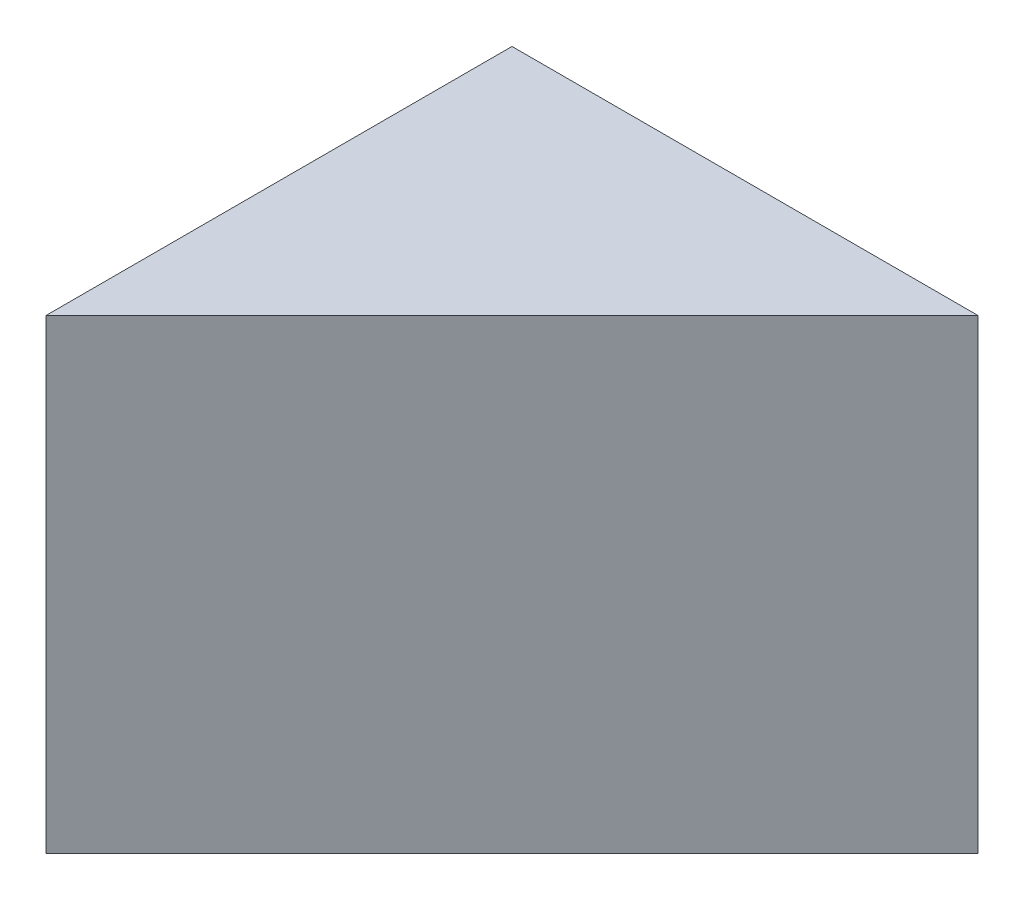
ISO-10303-21;
HEADER;
FILE_DESCRIPTION(('STEP AP214'),'2;1');
FILE_NAME('part.step','',(''),(''),'','','');
FILE_SCHEMA(('AUTOMOTIVE_DESIGN { 1 0 10303 214 1 1 1 1 }'));
ENDSEC;
DATA;
#1=APPLICATION_CONTEXT('core data for automotive mechanical design processes');
#2=APPLICATION_PROTOCOL_DEFINITION('international standard','automotive_design',2000,#1);
#3=PRODUCT_CONTEXT('',#1,'mechanical');
#4=PRODUCT('Part','Part','',(#3));
#5=PRODUCT_RELATED_PRODUCT_CATEGORY('part','',(#4));
#6=PRODUCT_DEFINITION_FORMATION('','',#4);
#7=PRODUCT_DEFINITION_CONTEXT('part definition',#1,'design');
#8=PRODUCT_DEFINITION('design','',#6,#7);
#9=PRODUCT_DEFINITION_SHAPE('','',#8);
#10=(LENGTH_UNIT() NAMED_UNIT(*) SI_UNIT(.MILLI.,.METRE.));
#11=(NAMED_UNIT(*) PLANE_ANGLE_UNIT() SI_UNIT($,.RADIAN.));
#12=(NAMED_UNIT(*) SI_UNIT($,.STERADIAN.) SOLID_ANGLE_UNIT());
#13=UNCERTAINTY_MEASURE_WITH_UNIT(LENGTH_MEASURE(1.E-05),#10,'distance_accuracy_value','');
#14=(GEOMETRIC_REPRESENTATION_CONTEXT(3) GLOBAL_UNCERTAINTY_ASSIGNED_CONTEXT((#13)) GLOBAL_UNIT_ASSIGNED_CONTEXT((#10,
#11,#12)) REPRESENTATION_CONTEXT('',''));
#15=CARTESIAN_POINT('',(0.,0.,0.));
#16=DIRECTION('',(0.,0.,1.));
#17=DIRECTION('',(1.,0.,0.));
#18=AXIS2_PLACEMENT_3D('',#15,#16,#17);
#19=CARTESIAN_POINT('',(0.,60.,-30.));
#20=DIRECTION('',(0.,0.,-1.));
#21=DIRECTION('',(-1.,0.,0.));
#22=AXIS2_PLACEMENT_3D('',#19,#20,#21);
#23=PLANE('',#22);
#24=DIRECTION('',(1.,0.,0.));
#25=VECTOR('',#24,1.);
#26=CARTESIAN_POINT('',(0.,0.,-30.));
#27=LINE('',#26,#25);
#28=CARTESIAN_POINT('',(-30.,0.,-30.));
#29=VERTEX_POINT('',#28);
#30=CARTESIAN_POINT('',(30.,0.,-30.));
#31=VERTEX_POINT('',#30);
#32=EDGE_CURVE('E88',#29,#31,#27,.T.);
#33=ORIENTED_EDGE('',*,*,#32,.F.);
#34=DIRECTION('',(0.,-1.,0.));
#35=VECTOR('',#34,1.);
#36=CARTESIAN_POINT('',(-30.,60.,-30.));
#37=LINE('',#36,#35);
#38=CARTESIAN_POINT('',(-30.,60.,-30.));
#39=VERTEX_POINT('',#38);
#40=EDGE_CURVE('E11',#39,#29,#37,.T.);
#41=ORIENTED_EDGE('',*,*,#40,.F.);
#42=DIRECTION('',(1.,0.,0.));
#43=VECTOR('',#42,1.);
#44=CARTESIAN_POINT('',(0.,60.,-30.));
#45=LINE('',#44,#43);
#46=CARTESIAN_POINT('',(30.,60.,-30.));
#47=VERTEX_POINT('',#46);
#48=EDGE_CURVE('E86',#39,#47,#45,.T.);
#49=ORIENTED_EDGE('',*,*,#48,.T.);
#50=DIRECTION('',(0.,-1.,0.));
#51=VECTOR('',#50,1.);
#52=CARTESIAN_POINT('',(30.,60.,-30.));
#53=LINE('',#52,#51);
#54=EDGE_CURVE('E82',#47,#31,#53,.T.);
#55=ORIENTED_EDGE('',*,*,#54,.T.);
#56=EDGE_LOOP('',(#33,#41,#49,#55));
#57=FACE_BOUND('',#56,.T.);
#58=ADVANCED_FACE('F47',(#57),#23,.T.);
#59=CARTESIAN_POINT('',(-30.,60.,0.));
#60=DIRECTION('',(1.,0.,0.));
#61=DIRECTION('',(0.,0.,-1.));
#62=AXIS2_PLACEMENT_3D('',#59,#60,#61);
#63=PLANE('',#62);
#64=DIRECTION('',(0.,0.,1.));
#65=VECTOR('',#64,1.);
#66=CARTESIAN_POINT('',(-30.,0.,0.));
#67=LINE('',#66,#65);
#68=CARTESIAN_POINT('',(-30.,0.,30.));
#69=VERTEX_POINT('',#68);
#70=EDGE_CURVE('E76',#29,#69,#67,.T.);
#71=ORIENTED_EDGE('',*,*,#70,.T.);
#72=DIRECTION('',(0.,-1.,0.));
#73=VECTOR('',#72,1.);
#74=CARTESIAN_POINT('',(-30.,60.,30.));
#75=LINE('',#74,#73);
#76=CARTESIAN_POINT('',(-30.,60.,30.));
#77=VERTEX_POINT('',#76);
#78=EDGE_CURVE('E56',#77,#69,#75,.T.);
#79=ORIENTED_EDGE('',*,*,#78,.F.);
#80=DIRECTION('',(0.,0.,1.));
#81=VECTOR('',#80,1.);
#82=CARTESIAN_POINT('',(-30.,60.,0.));
#83=LINE('',#82,#81);
#84=EDGE_CURVE('E89',#39,#77,#83,.T.);
#85=ORIENTED_EDGE('',*,*,#84,.F.);
#86=ORIENTED_EDGE('',*,*,#40,.T.);
#87=EDGE_LOOP('',(#71,#79,#85,#86));
#88=FACE_BOUND('',#87,.T.);
#89=ADVANCED_FACE('F90',(#88),#63,.F.);
#90=CARTESIAN_POINT('',(0.,60.,0.));
#91=DIRECTION('',(-0.707106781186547,0.,-0.707106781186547));
#92=DIRECTION('',(-0.707106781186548,0.,0.707106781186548));
#93=AXIS2_PLACEMENT_3D('',#90,#91,#92);
#94=PLANE('',#93);
#95=DIRECTION('',(0.707106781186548,0.,-0.707106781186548));
#96=VECTOR('',#95,1.);
#97=CARTESIAN_POINT('',(0.,0.,0.));
#98=LINE('',#97,#96);
#99=EDGE_CURVE('E95',#69,#31,#98,.T.);
#100=ORIENTED_EDGE('',*,*,#99,.T.);
#101=ORIENTED_EDGE('',*,*,#54,.F.);
#102=DIRECTION('',(0.707106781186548,0.,-0.707106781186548));
#103=VECTOR('',#102,1.);
#104=CARTESIAN_POINT('',(0.,60.,0.));
#105=LINE('',#104,#103);
#106=EDGE_CURVE('E64',#77,#47,#105,.T.);
#107=ORIENTED_EDGE('',*,*,#106,.F.);
#108=ORIENTED_EDGE('',*,*,#78,.T.);
#109=EDGE_LOOP('',(#100,#101,#107,#108));
#110=FACE_BOUND('',#109,.T.);
#111=ADVANCED_FACE('F110',(#110),#94,.F.);
#112=CARTESIAN_POINT('',(0.,60.,0.));
#113=DIRECTION('',(0.,1.,0.));
#114=DIRECTION('',(0.,0.,1.));
#115=AXIS2_PLACEMENT_3D('',#112,#113,#114);
#116=PLANE('',#115);
#117=ORIENTED_EDGE('',*,*,#48,.F.);
#118=ORIENTED_EDGE('',*,*,#84,.T.);
#119=ORIENTED_EDGE('',*,*,#106,.T.);
#120=EDGE_LOOP('',(#117,#118,#119));
#121=FACE_BOUND('',#120,.T.);
#122=ADVANCED_FACE('F93',(#121),#116,.T.);
#123=CARTESIAN_POINT('',(0.,0.,0.));
#124=DIRECTION('',(0.,1.,0.));
#125=DIRECTION('',(0.,0.,1.));
#126=AXIS2_PLACEMENT_3D('',#123,#124,#125);
#127=PLANE('',#126);
#128=ORIENTED_EDGE('',*,*,#32,.T.);
#129=ORIENTED_EDGE('',*,*,#99,.F.);
#130=ORIENTED_EDGE('',*,*,#70,.F.);
#131=EDGE_LOOP('',(#128,#129,#130));
#132=FACE_BOUND('',#131,.T.);
#133=ADVANCED_FACE('F112',(#132),#127,.F.);
#134=CLOSED_SHELL('',(#58,#89,#111,#122,#133));
#135=MANIFOLD_SOLID_BREP('B2',#134);
#136=ADVANCED_BREP_SHAPE_REPRESENTATION('',(#18,#135),#14);
#137=SHAPE_DEFINITION_REPRESENTATION(#9,#136);
ENDSEC;
END-ISO-10303-21;
